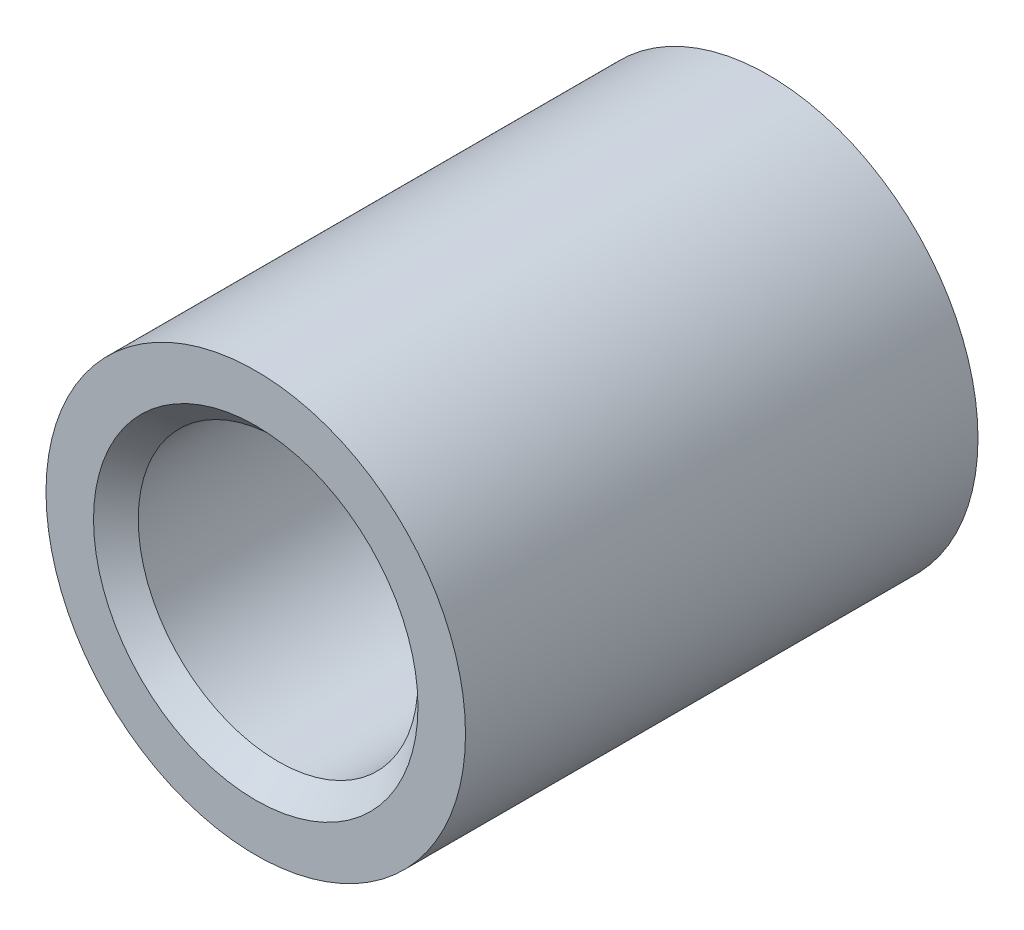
ISO-10303-21;
HEADER;
FILE_DESCRIPTION(('STEP AP214'),'2;1');
FILE_NAME('part.step','',(''),(''),'','','');
FILE_SCHEMA(('AUTOMOTIVE_DESIGN { 1 0 10303 214 1 1 1 1 }'));
ENDSEC;
DATA;
#1=APPLICATION_CONTEXT('core data for automotive mechanical design processes');
#2=APPLICATION_PROTOCOL_DEFINITION('international standard','automotive_design',2000,#1);
#3=PRODUCT_CONTEXT('',#1,'mechanical');
#4=PRODUCT('Part','Part','',(#3));
#5=PRODUCT_RELATED_PRODUCT_CATEGORY('part','',(#4));
#6=PRODUCT_DEFINITION_FORMATION('','',#4);
#7=PRODUCT_DEFINITION_CONTEXT('part definition',#1,'design');
#8=PRODUCT_DEFINITION('design','',#6,#7);
#9=PRODUCT_DEFINITION_SHAPE('','',#8);
#10=(LENGTH_UNIT() NAMED_UNIT(*) SI_UNIT(.MILLI.,.METRE.));
#11=(NAMED_UNIT(*) PLANE_ANGLE_UNIT() SI_UNIT($,.RADIAN.));
#12=(NAMED_UNIT(*) SI_UNIT($,.STERADIAN.) SOLID_ANGLE_UNIT());
#13=UNCERTAINTY_MEASURE_WITH_UNIT(LENGTH_MEASURE(1.E-05),#10,'distance_accuracy_value','');
#14=(GEOMETRIC_REPRESENTATION_CONTEXT(3) GLOBAL_UNCERTAINTY_ASSIGNED_CONTEXT((#13)) GLOBAL_UNIT_ASSIGNED_CONTEXT((#10,
#11,#12)) REPRESENTATION_CONTEXT('',''));
#15=CARTESIAN_POINT('',(0.,0.,0.));
#16=DIRECTION('',(0.,0.,1.));
#17=DIRECTION('',(1.,0.,0.));
#18=AXIS2_PLACEMENT_3D('',#15,#16,#17);
#19=CARTESIAN_POINT('',(0.,0.,31.775));
#20=DIRECTION('',(0.,0.,1.));
#21=DIRECTION('',(1.,0.,0.));
#22=AXIS2_PLACEMENT_3D('',#19,#20,#21);
#23=CYLINDRICAL_SURFACE('',#22,14.29385);
#24=CARTESIAN_POINT('',(0.,0.,0.));
#25=DIRECTION('',(0.,0.,1.));
#26=DIRECTION('',(1.,0.,0.));
#27=AXIS2_PLACEMENT_3D('',#24,#25,#26);
#28=CIRCLE('',#27,14.29385);
#29=CARTESIAN_POINT('',(14.29385,0.,0.));
#30=VERTEX_POINT('',#29);
#31=EDGE_CURVE('E32',#30,#30,#28,.T.);
#32=ORIENTED_EDGE('',*,*,#31,.F.);
#33=EDGE_LOOP('',(#32));
#34=FACE_BOUND('',#33,.T.);
#35=CARTESIAN_POINT('',(0.,0.,-34.925));
#36=DIRECTION('',(0.,0.,1.));
#37=DIRECTION('',(1.,0.,0.));
#38=AXIS2_PLACEMENT_3D('',#35,#36,#37);
#39=CIRCLE('',#38,14.29385);
#40=CARTESIAN_POINT('',(14.29385,0.,-34.925));
#41=VERTEX_POINT('',#40);
#42=EDGE_CURVE('E35',#41,#41,#39,.T.);
#43=ORIENTED_EDGE('',*,*,#42,.T.);
#44=EDGE_LOOP('',(#43));
#45=FACE_BOUND('',#44,.T.);
#46=ADVANCED_FACE('F13',(#34,#45),#23,.T.);
#47=CARTESIAN_POINT('',(14.29385,0.,0.));
#48=DIRECTION('',(0.,0.,-1.));
#49=DIRECTION('',(-1.,0.,0.));
#50=AXIS2_PLACEMENT_3D('',#47,#48,#49);
#51=PLANE('',#50);
#52=CARTESIAN_POINT('',(0.,0.,0.));
#53=DIRECTION('',(0.,0.,-1.));
#54=DIRECTION('',(-1.,0.,0.));
#55=AXIS2_PLACEMENT_3D('',#52,#53,#54);
#56=CIRCLE('',#55,11.05535);
#57=CARTESIAN_POINT('',(-11.05535,0.,0.));
#58=VERTEX_POINT('',#57);
#59=EDGE_CURVE('E9',#58,#58,#56,.T.);
#60=ORIENTED_EDGE('',*,*,#59,.T.);
#61=EDGE_LOOP('',(#60));
#62=FACE_BOUND('',#61,.T.);
#63=ORIENTED_EDGE('',*,*,#31,.T.);
#64=EDGE_LOOP('',(#63));
#65=FACE_BOUND('',#64,.T.);
#66=ADVANCED_FACE('F55',(#62,#65),#51,.F.);
#67=CARTESIAN_POINT('',(0.,0.,31.775));
#68=DIRECTION('',(0.,0.,1.));
#69=DIRECTION('',(1.,0.,0.));
#70=AXIS2_PLACEMENT_3D('',#67,#68,#69);
#71=CYLINDRICAL_SURFACE('',#70,9.53135);
#72=CARTESIAN_POINT('',(0.,0.,-33.401));
#73=DIRECTION('',(0.,0.,1.));
#74=DIRECTION('',(1.,0.,0.));
#75=AXIS2_PLACEMENT_3D('',#72,#73,#74);
#76=CIRCLE('',#75,9.53135);
#77=CARTESIAN_POINT('',(9.53135,0.,-33.401));
#78=VERTEX_POINT('',#77);
#79=EDGE_CURVE('E19',#78,#78,#76,.F.);
#80=ORIENTED_EDGE('',*,*,#79,.T.);
#81=EDGE_LOOP('',(#80));
#82=FACE_BOUND('',#81,.T.);
#83=CARTESIAN_POINT('',(0.,0.,-1.524));
#84=DIRECTION('',(0.,0.,-1.));
#85=DIRECTION('',(-1.,0.,0.));
#86=AXIS2_PLACEMENT_3D('',#83,#84,#85);
#87=CIRCLE('',#86,9.53135);
#88=CARTESIAN_POINT('',(-9.53135,0.,-1.524));
#89=VERTEX_POINT('',#88);
#90=EDGE_CURVE('E23',#89,#89,#87,.F.);
#91=ORIENTED_EDGE('',*,*,#90,.T.);
#92=EDGE_LOOP('',(#91));
#93=FACE_BOUND('',#92,.T.);
#94=ADVANCED_FACE('F43',(#82,#93),#71,.F.);
#95=CARTESIAN_POINT('',(9.53135,0.,-34.925));
#96=DIRECTION('',(0.,0.,1.));
#97=DIRECTION('',(1.,0.,0.));
#98=AXIS2_PLACEMENT_3D('',#95,#96,#97);
#99=PLANE('',#98);
#100=CARTESIAN_POINT('',(0.,0.,-34.925));
#101=DIRECTION('',(0.,0.,1.));
#102=DIRECTION('',(1.,0.,0.));
#103=AXIS2_PLACEMENT_3D('',#100,#101,#102);
#104=CIRCLE('',#103,11.05535);
#105=CARTESIAN_POINT('',(11.05535,0.,-34.925));
#106=VERTEX_POINT('',#105);
#107=EDGE_CURVE('E27',#106,#106,#104,.T.);
#108=ORIENTED_EDGE('',*,*,#107,.T.);
#109=EDGE_LOOP('',(#108));
#110=FACE_BOUND('',#109,.T.);
#111=ORIENTED_EDGE('',*,*,#42,.F.);
#112=EDGE_LOOP('',(#111));
#113=FACE_BOUND('',#112,.T.);
#114=ADVANCED_FACE('F40',(#110,#113),#99,.F.);
#115=CARTESIAN_POINT('',(0.,0.,-34.925));
#116=DIRECTION('',(0.,0.,-1.));
#117=DIRECTION('',(-1.,0.,0.));
#118=AXIS2_PLACEMENT_3D('',#115,#116,#117);
#119=CONICAL_SURFACE('',#118,11.05535,0.785398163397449);
#120=ORIENTED_EDGE('',*,*,#79,.F.);
#121=EDGE_LOOP('',(#120));
#122=FACE_BOUND('',#121,.T.);
#123=ORIENTED_EDGE('',*,*,#107,.F.);
#124=EDGE_LOOP('',(#123));
#125=FACE_BOUND('',#124,.T.);
#126=ADVANCED_FACE('F42',(#122,#125),#119,.F.);
#127=CARTESIAN_POINT('',(0.,0.,-1.524));
#128=DIRECTION('',(0.,0.,1.));
#129=DIRECTION('',(1.,0.,0.));
#130=AXIS2_PLACEMENT_3D('',#127,#128,#129);
#131=CONICAL_SURFACE('',#130,9.53135,0.785398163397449);
#132=ORIENTED_EDGE('',*,*,#59,.F.);
#133=EDGE_LOOP('',(#132));
#134=FACE_BOUND('',#133,.T.);
#135=ORIENTED_EDGE('',*,*,#90,.F.);
#136=EDGE_LOOP('',(#135));
#137=FACE_BOUND('',#136,.T.);
#138=ADVANCED_FACE('F52',(#134,#137),#131,.F.);
#139=CLOSED_SHELL('',(#46,#66,#94,#114,#126,#138));
#140=MANIFOLD_SOLID_BREP('B1',#139);
#141=ADVANCED_BREP_SHAPE_REPRESENTATION('',(#18,#140),#14);
#142=SHAPE_DEFINITION_REPRESENTATION(#9,#141);
ENDSEC;
END-ISO-10303-21;
